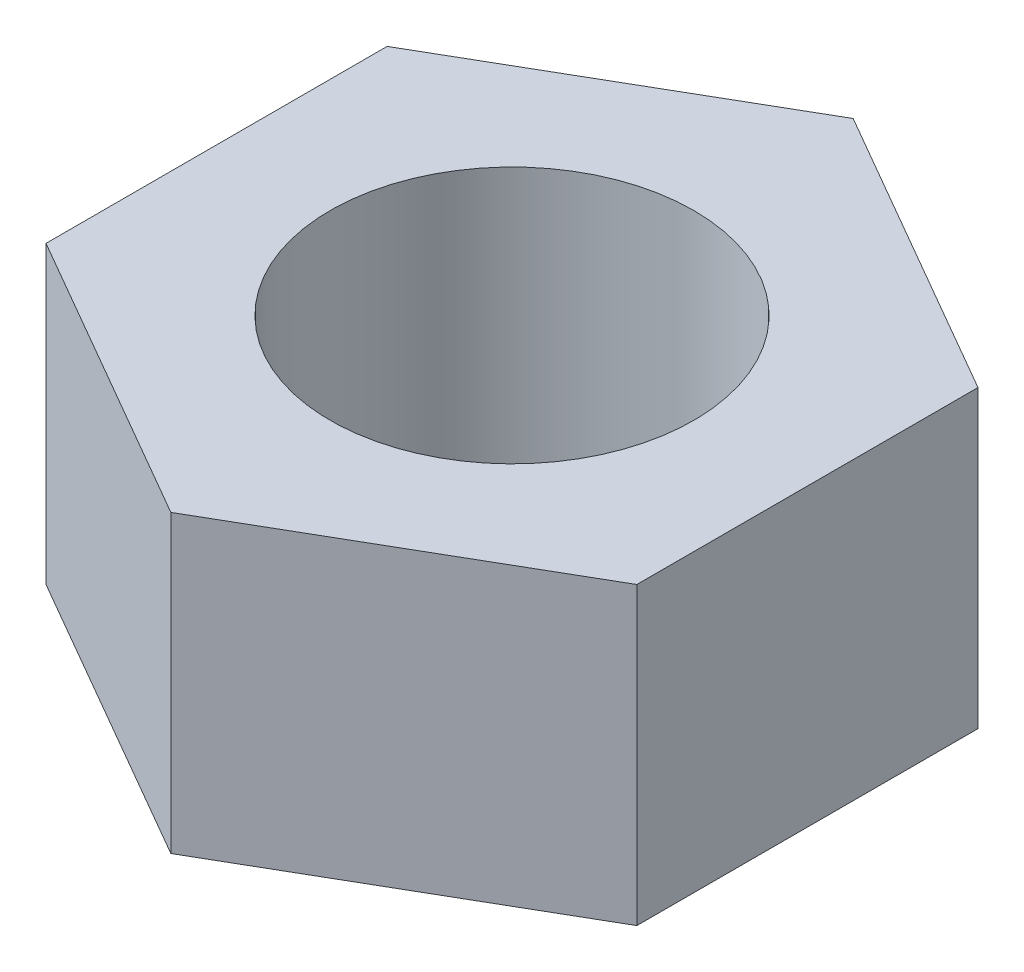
from build123d import *

# Parameters (mm, degrees)
ESQUISSE1_R      = 4
EXTRUSION1_DEPTH = 6.5


with BuildPart() as part:
    # Esquisse1 → Extrusion1 (new body)
    with BuildSketch(Plane(origin=(0, 0, 0), x_dir=(1, 0, 0), z_dir=(0, 1, 0))):
        Polygon((-6.5, 3.75277675), (-6.5, -3.75277675), (0, -7.505553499), (6.5, -3.75277675), (6.5, 3.75277675), (0, 7.505553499), align=None)
        with Locations(Location((0, 0, 0), (0, 0, 90))):
            Circle(ESQUISSE1_R, mode=Mode.SUBTRACT)
    extrude(amount=EXTRUSION1_DEPTH)


solid = part.part
